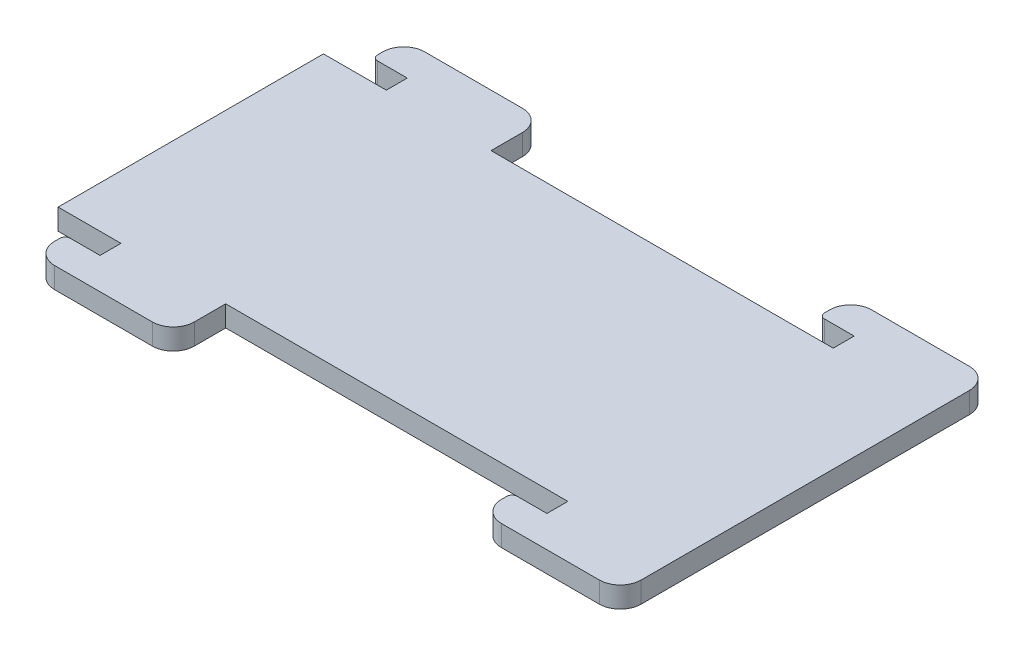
from build123d import *

# Parameters (mm, degrees)
BOSS_EXTRUDE1_DEPTH = 3
FILLET1_R           = 3
FILLET2_R           = 0.75


with BuildPart() as part:
    # Sketch1 → Boss-Extrude1 (new body)
    with BuildSketch(Plane(origin=(0, 0, 0), x_dir=(1, 0, 0), z_dir=(0, 1, 0))):
        Polygon((0, 0), (9, 0), (9, -3), (4, -3), (4, -7.5), (24, -7.5), (24, -3), (24, 0), (73, 0), (73, -3), (68, -3), (68, -7.5), (88, -7.5), (88, -3), (88, 0), (88, 38), (88, 41), (88, 45.5), (68, 45.5), (68, 41), (73, 41), (73, 38), (24, 38), (24, 41), (24, 45.5), (4, 45.5), (4, 41), (9, 41), (9, 38), (0, 38), align=None)
    extrude(amount=BOSS_EXTRUDE1_DEPTH)

    # Fillet1
    fillet1_edges = [part.edges().sort_by_distance(p)[0] for p in [
        (4, 1.5, -45.5),
        (24, 1.5, -45.5),
        (68, 1.5, -45.5),
        (88, 1.5, -45.5),
        (88, 1.5, 7.5),
        (68, 1.5, 7.5),
        (24, 1.5, 7.5),
        (4, 1.5, 7.5),
    ]]
    fillet(fillet1_edges, radius=FILLET1_R)

    # Fillet2
    fillet2_edges = [part.edges().sort_by_distance(p)[0] for p in [
        (4, 1.5, -41),
        (68, 1.5, -41),
        (68, 1.5, 3),
        (4, 1.5, 3),
    ]]
    fillet(fillet2_edges, radius=FILLET2_R)


solid = part.part
